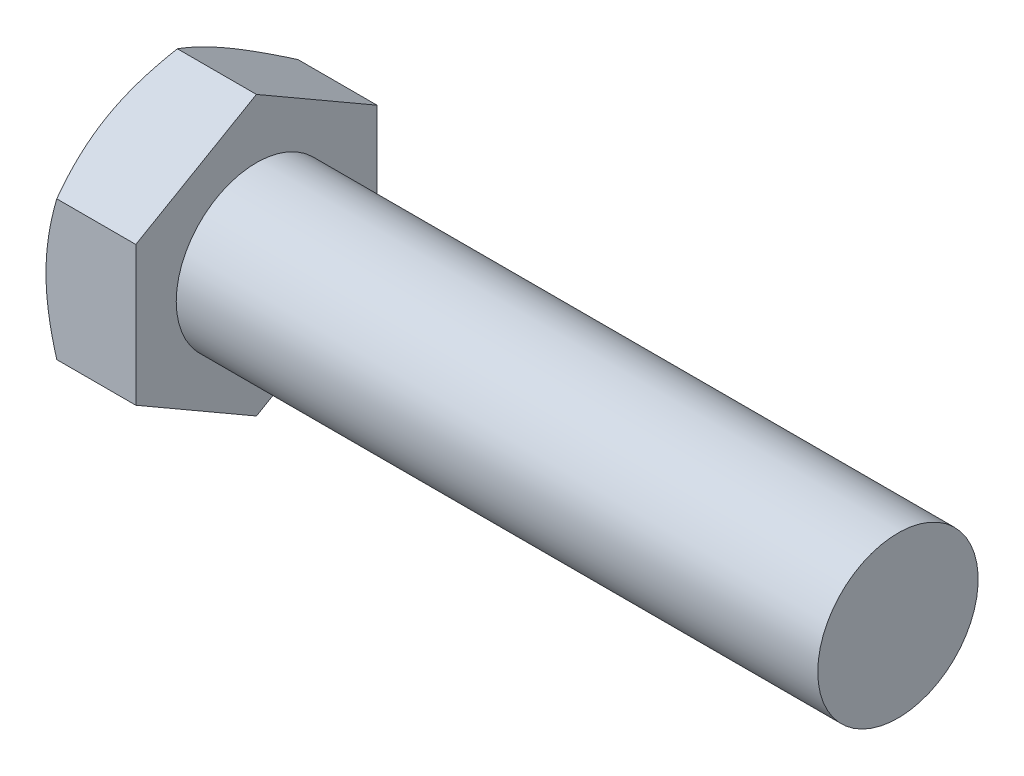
from build123d import *

# Parameters (mm, degrees)
SKETCH2_R     = 2.784614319
HEX_DIE_DEPTH = 1.778
SKETCH4_R     = 2.08915
INDENT_DEPTH  = 0.22225


with BuildPart() as part:
    # BodySke → Base-Revolve (revolve)
    with BuildSketch(Plane.XY, mode=Mode.PRIVATE) as base_revolve_sk:
        Polygon((1.778, 1.5875), (1.778, 2.75704388), (0.213298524, 2.75704388), (0, 2.3876), (0, 0), (14.478, 0), (14.478, 1.5875), align=None)
    revolve(base_revolve_sk.sketch.rotate(Axis((-25.4, 0, 0), (1, 0, 0)), 90), axis=Axis((-25.4, 0, 0), (1, 0, 0)))

    # Sketch2 → Hex-Die (cut)
    with BuildSketch(Plane(origin=(0, 0, 0), x_dir=(0, 0, -1), z_dir=(1, 0, 0))):
        Circle(SKETCH2_R)
        Polygon((-2.3876, 1.378481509), (0, 2.756963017), (2.3876, 1.378481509), (2.3876, -1.378481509), (0, -2.756963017), (-2.3876, -1.378481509), align=None, mode=Mode.SUBTRACT)
    extrude(amount=HEX_DIE_DEPTH, mode=Mode.SUBTRACT)

    # Sketch4 → Indent (cut)
    with BuildSketch(Plane(origin=(0, 0, 0), x_dir=(0, 0, -1), z_dir=(1, 0, 0))):
        Circle(SKETCH4_R)
    extrude(amount=INDENT_DEPTH, mode=Mode.SUBTRACT)


solid = part.part
